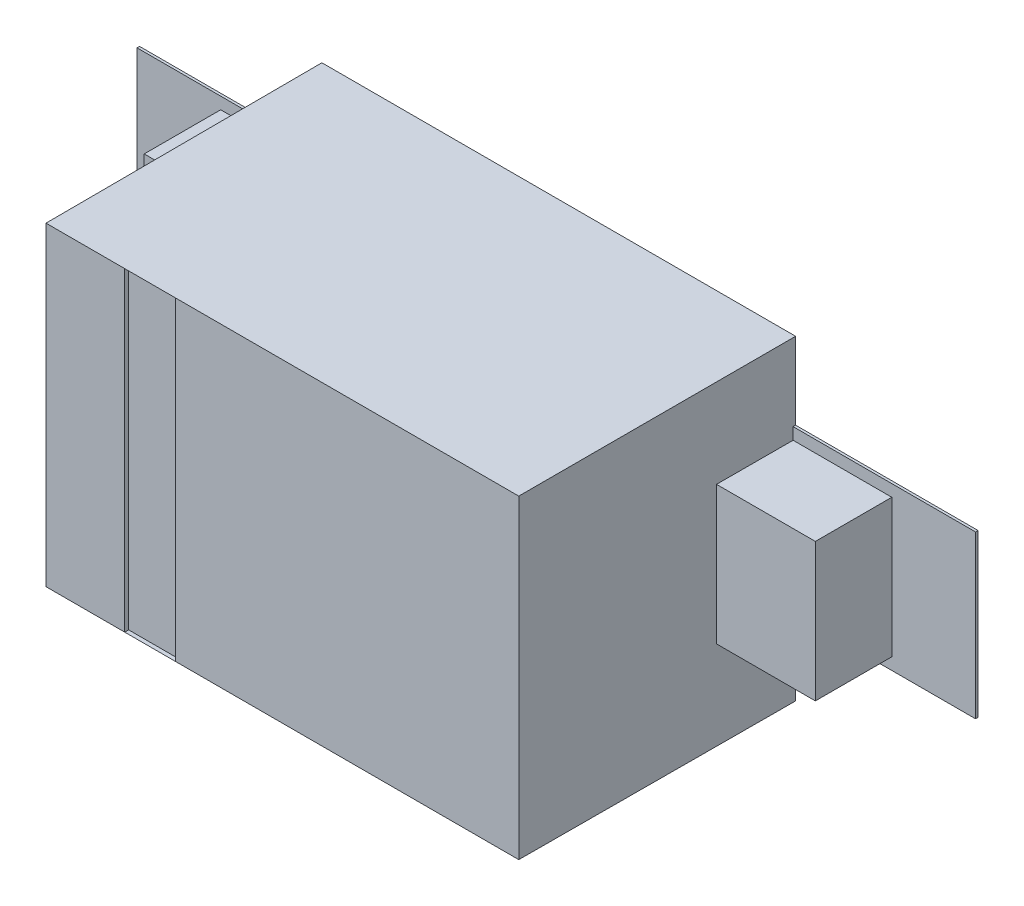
ISO-10303-21;
HEADER;
FILE_DESCRIPTION(('STEP AP214'),'2;1');
FILE_NAME('part.step','',(''),(''),'','','');
FILE_SCHEMA(('AUTOMOTIVE_DESIGN { 1 0 10303 214 1 1 1 1 }'));
ENDSEC;
DATA;
#1=APPLICATION_CONTEXT('core data for automotive mechanical design processes');
#2=APPLICATION_PROTOCOL_DEFINITION('international standard','automotive_design',2000,#1);
#3=PRODUCT_CONTEXT('',#1,'mechanical');
#4=PRODUCT('Part','Part','',(#3));
#5=PRODUCT_RELATED_PRODUCT_CATEGORY('part','',(#4));
#6=PRODUCT_DEFINITION_FORMATION('','',#4);
#7=PRODUCT_DEFINITION_CONTEXT('part definition',#1,'design');
#8=PRODUCT_DEFINITION('design','',#6,#7);
#9=PRODUCT_DEFINITION_SHAPE('','',#8);
#10=(LENGTH_UNIT() NAMED_UNIT(*) SI_UNIT(.MILLI.,.METRE.));
#11=(NAMED_UNIT(*) PLANE_ANGLE_UNIT() SI_UNIT($,.RADIAN.));
#12=(NAMED_UNIT(*) SI_UNIT($,.STERADIAN.) SOLID_ANGLE_UNIT());
#13=UNCERTAINTY_MEASURE_WITH_UNIT(LENGTH_MEASURE(1.E-05),#10,'distance_accuracy_value','');
#14=(GEOMETRIC_REPRESENTATION_CONTEXT(3) GLOBAL_UNCERTAINTY_ASSIGNED_CONTEXT((#13)) GLOBAL_UNIT_ASSIGNED_CONTEXT((#10,
#11,#12)) REPRESENTATION_CONTEXT('',''));
#15=CARTESIAN_POINT('',(0.,0.,0.));
#16=DIRECTION('',(0.,0.,1.));
#17=DIRECTION('',(1.,0.,0.));
#18=AXIS2_PLACEMENT_3D('',#15,#16,#17);
#19=CARTESIAN_POINT('',(0.849999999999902,0.175000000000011,0.0030000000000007));
#20=DIRECTION('',(1.,0.,0.));
#21=DIRECTION('',(0.,0.,-1.));
#22=AXIS2_PLACEMENT_3D('',#19,#20,#21);
#23=PLANE('',#22);
#24=DIRECTION('',(0.,0.,-1.));
#25=VECTOR('',#24,1.);
#26=CARTESIAN_POINT('',(0.849999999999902,-0.175000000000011,0.0030000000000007));
#27=LINE('',#26,#25);
#28=CARTESIAN_POINT('',(0.849999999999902,-0.175000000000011,0.0093500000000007));
#29=VERTEX_POINT('',#28);
#30=CARTESIAN_POINT('',(0.849999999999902,-0.175000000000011,0.203000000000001));
#31=VERTEX_POINT('',#30);
#32=EDGE_CURVE('E180',#29,#31,#27,.F.);
#33=ORIENTED_EDGE('',*,*,#32,.F.);
#34=DIRECTION('',(0.,1.,0.));
#35=VECTOR('',#34,1.);
#36=CARTESIAN_POINT('',(0.849999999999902,0.,0.0093500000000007));
#37=LINE('',#36,#35);
#38=CARTESIAN_POINT('',(0.849999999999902,0.175000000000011,0.0093500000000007));
#39=VERTEX_POINT('',#38);
#40=EDGE_CURVE('E260',#29,#39,#37,.T.);
#41=ORIENTED_EDGE('',*,*,#40,.T.);
#42=DIRECTION('',(0.,0.,1.));
#43=VECTOR('',#42,1.);
#44=CARTESIAN_POINT('',(0.849999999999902,0.175000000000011,0.0030000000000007));
#45=LINE('',#44,#43);
#46=CARTESIAN_POINT('',(0.849999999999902,0.175000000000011,0.203000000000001));
#47=VERTEX_POINT('',#46);
#48=EDGE_CURVE('E196',#47,#39,#45,.F.);
#49=ORIENTED_EDGE('',*,*,#48,.F.);
#50=DIRECTION('',(0.,1.,0.));
#51=VECTOR('',#50,1.);
#52=CARTESIAN_POINT('',(0.849999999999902,0.,0.203000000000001));
#53=LINE('',#52,#51);
#54=EDGE_CURVE('E174',#47,#31,#53,.F.);
#55=ORIENTED_EDGE('',*,*,#54,.T.);
#56=EDGE_LOOP('',(#33,#41,#49,#55));
#57=FACE_BOUND('',#56,.T.);
#58=ADVANCED_FACE('F16',(#57),#23,.T.);
#59=CARTESIAN_POINT('',(-0.849999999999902,-0.175000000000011,0.0030000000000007));
#60=DIRECTION('',(-1.,0.,0.));
#61=DIRECTION('',(0.,0.,1.));
#62=AXIS2_PLACEMENT_3D('',#59,#60,#61);
#63=PLANE('',#62);
#64=DIRECTION('',(0.,0.,1.));
#65=VECTOR('',#64,1.);
#66=CARTESIAN_POINT('',(-0.849999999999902,0.175000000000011,0.0030000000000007));
#67=LINE('',#66,#65);
#68=CARTESIAN_POINT('',(-0.849999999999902,0.175000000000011,0.0093500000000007));
#69=VERTEX_POINT('',#68);
#70=CARTESIAN_POINT('',(-0.849999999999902,0.175000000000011,0.203000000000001));
#71=VERTEX_POINT('',#70);
#72=EDGE_CURVE('E249',#69,#71,#67,.T.);
#73=ORIENTED_EDGE('',*,*,#72,.F.);
#74=DIRECTION('',(0.,1.,0.));
#75=VECTOR('',#74,1.);
#76=CARTESIAN_POINT('',(-0.849999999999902,0.,0.0093500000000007));
#77=LINE('',#76,#75);
#78=CARTESIAN_POINT('',(-0.849999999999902,-0.175000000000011,0.0093500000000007));
#79=VERTEX_POINT('',#78);
#80=EDGE_CURVE('E232',#69,#79,#77,.F.);
#81=ORIENTED_EDGE('',*,*,#80,.T.);
#82=DIRECTION('',(0.,0.,-1.));
#83=VECTOR('',#82,1.);
#84=CARTESIAN_POINT('',(-0.849999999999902,-0.175000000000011,0.0030000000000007));
#85=LINE('',#84,#83);
#86=CARTESIAN_POINT('',(-0.849999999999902,-0.175000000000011,0.203000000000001));
#87=VERTEX_POINT('',#86);
#88=EDGE_CURVE('E238',#87,#79,#85,.T.);
#89=ORIENTED_EDGE('',*,*,#88,.F.);
#90=DIRECTION('',(0.,1.,0.));
#91=VECTOR('',#90,1.);
#92=CARTESIAN_POINT('',(-0.849999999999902,0.,0.203000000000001));
#93=LINE('',#92,#91);
#94=EDGE_CURVE('E246',#87,#71,#93,.T.);
#95=ORIENTED_EDGE('',*,*,#94,.T.);
#96=EDGE_LOOP('',(#73,#81,#89,#95));
#97=FACE_BOUND('',#96,.T.);
#98=ADVANCED_FACE('F498',(#97),#63,.T.);
#99=CARTESIAN_POINT('',(-0.399389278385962,0.398778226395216,0.703023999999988));
#100=DIRECTION('',(-1.,0.,0.));
#101=DIRECTION('',(0.,0.,1.));
#102=AXIS2_PLACEMENT_3D('',#99,#100,#101);
#103=PLANE('',#102);
#104=DIRECTION('',(0.,1.,0.));
#105=VECTOR('',#104,1.);
#106=CARTESIAN_POINT('',(-0.399389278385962,0.,0.693024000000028));
#107=LINE('',#106,#105);
#108=CARTESIAN_POINT('',(-0.399389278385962,0.398778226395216,0.693024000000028));
#109=VERTEX_POINT('',#108);
#110=CARTESIAN_POINT('',(-0.399389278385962,-0.398778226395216,0.693024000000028));
#111=VERTEX_POINT('',#110);
#112=EDGE_CURVE('E19',#109,#111,#107,.F.);
#113=ORIENTED_EDGE('',*,*,#112,.F.);
#114=DIRECTION('',(0.,0.,1.));
#115=VECTOR('',#114,1.);
#116=CARTESIAN_POINT('',(-0.399389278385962,0.398778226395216,0.703023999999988));
#117=LINE('',#116,#115);
#118=CARTESIAN_POINT('',(-0.399389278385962,0.398778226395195,0.703023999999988));
#119=VERTEX_POINT('',#118);
#120=EDGE_CURVE('E251',#109,#119,#117,.T.);
#121=ORIENTED_EDGE('',*,*,#120,.T.);
#122=DIRECTION('',(0.,1.,0.));
#123=VECTOR('',#122,1.);
#124=CARTESIAN_POINT('',(-0.399389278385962,0.,0.703023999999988));
#125=LINE('',#124,#123);
#126=CARTESIAN_POINT('',(-0.399389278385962,-0.398778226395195,0.703023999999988));
#127=VERTEX_POINT('',#126);
#128=EDGE_CURVE('E221',#127,#119,#125,.T.);
#129=ORIENTED_EDGE('',*,*,#128,.F.);
#130=DIRECTION('',(0.,0.,-1.));
#131=VECTOR('',#130,1.);
#132=CARTESIAN_POINT('',(-0.399389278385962,-0.398778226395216,0.703023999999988));
#133=LINE('',#132,#131);
#134=EDGE_CURVE('E215',#127,#111,#133,.T.);
#135=ORIENTED_EDGE('',*,*,#134,.T.);
#136=EDGE_LOOP('',(#113,#121,#129,#135));
#137=FACE_BOUND('',#136,.T.);
#138=ADVANCED_FACE('F220',(#137),#103,.F.);
#139=CARTESIAN_POINT('',(0.,0.,0.693024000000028));
#140=DIRECTION('',(0.,0.,1.));
#141=DIRECTION('',(1.,0.,0.));
#142=AXIS2_PLACEMENT_3D('',#139,#140,#141);
#143=PLANE('',#142);
#144=DIRECTION('',(1.,0.,0.));
#145=VECTOR('',#144,1.);
#146=CARTESIAN_POINT('',(-0.270648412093,0.398778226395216,0.693024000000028));
#147=LINE('',#146,#145);
#148=CARTESIAN_POINT('',(-0.270648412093,0.398778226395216,0.693024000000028));
#149=VERTEX_POINT('',#148);
#150=EDGE_CURVE('E206',#149,#109,#147,.F.);
#151=ORIENTED_EDGE('',*,*,#150,.T.);
#152=ORIENTED_EDGE('',*,*,#112,.T.);
#153=DIRECTION('',(1.,0.,0.));
#154=VECTOR('',#153,1.);
#155=CARTESIAN_POINT('',(-0.399389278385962,-0.398778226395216,0.693024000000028));
#156=LINE('',#155,#154);
#157=CARTESIAN_POINT('',(-0.270648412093,-0.398778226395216,0.693024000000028));
#158=VERTEX_POINT('',#157);
#159=EDGE_CURVE('E205',#111,#158,#156,.T.);
#160=ORIENTED_EDGE('',*,*,#159,.T.);
#161=DIRECTION('',(0.,1.,0.));
#162=VECTOR('',#161,1.);
#163=CARTESIAN_POINT('',(-0.270648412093,-0.398778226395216,0.693024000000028));
#164=LINE('',#163,#162);
#165=EDGE_CURVE('E189',#158,#149,#164,.T.);
#166=ORIENTED_EDGE('',*,*,#165,.T.);
#167=EDGE_LOOP('',(#151,#152,#160,#166));
#168=FACE_BOUND('',#167,.T.);
#169=ADVANCED_FACE('F204',(#168),#143,.T.);
#170=CARTESIAN_POINT('',(-0.270648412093,-0.398778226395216,0.703023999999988));
#171=DIRECTION('',(1.,0.,0.));
#172=DIRECTION('',(0.,0.,-1.));
#173=AXIS2_PLACEMENT_3D('',#170,#171,#172);
#174=PLANE('',#173);
#175=ORIENTED_EDGE('',*,*,#165,.F.);
#176=DIRECTION('',(0.,0.,-1.));
#177=VECTOR('',#176,1.);
#178=CARTESIAN_POINT('',(-0.270648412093,-0.398778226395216,0.703023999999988));
#179=LINE('',#178,#177);
#180=CARTESIAN_POINT('',(-0.270648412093,-0.398778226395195,0.703023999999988));
#181=VERTEX_POINT('',#180);
#182=EDGE_CURVE('E218',#158,#181,#179,.F.);
#183=ORIENTED_EDGE('',*,*,#182,.T.);
#184=DIRECTION('',(0.,1.,0.));
#185=VECTOR('',#184,1.);
#186=CARTESIAN_POINT('',(-0.270648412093,0.,0.703023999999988));
#187=LINE('',#186,#185);
#188=CARTESIAN_POINT('',(-0.270648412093,0.398778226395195,0.703023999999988));
#189=VERTEX_POINT('',#188);
#190=EDGE_CURVE('E223',#189,#181,#187,.F.);
#191=ORIENTED_EDGE('',*,*,#190,.F.);
#192=DIRECTION('',(0.,0.,1.));
#193=VECTOR('',#192,1.);
#194=CARTESIAN_POINT('',(-0.270648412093,0.398778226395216,0.703023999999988));
#195=LINE('',#194,#193);
#196=EDGE_CURVE('E254',#189,#149,#195,.F.);
#197=ORIENTED_EDGE('',*,*,#196,.T.);
#198=EDGE_LOOP('',(#175,#183,#191,#197));
#199=FACE_BOUND('',#198,.T.);
#200=ADVANCED_FACE('F301',(#199),#174,.F.);
#201=CARTESIAN_POINT('',(0.849999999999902,-0.175000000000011,0.0030000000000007));
#202=DIRECTION('',(0.,-1.,0.));
#203=DIRECTION('',(0.,0.,-1.));
#204=AXIS2_PLACEMENT_3D('',#201,#202,#203);
#205=PLANE('',#204);
#206=DIRECTION('',(0.00174532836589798,0.,-0.999998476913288));
#207=VECTOR('',#206,1.);
#208=CARTESIAN_POINT('',(0.599999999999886,-0.175000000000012,0.0030000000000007));
#209=LINE('',#208,#207);
#210=CARTESIAN_POINT('',(0.599988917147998,-0.175000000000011,0.00935000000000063));
#211=VERTEX_POINT('',#210);
#212=CARTESIAN_POINT('',(0.599650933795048,-0.175000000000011,0.203000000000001));
#213=VERTEX_POINT('',#212);
#214=EDGE_CURVE('E275',#211,#213,#209,.F.);
#215=ORIENTED_EDGE('',*,*,#214,.F.);
#216=DIRECTION('',(-1.,0.,0.));
#217=VECTOR('',#216,1.);
#218=CARTESIAN_POINT('',(0.,-0.175000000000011,0.0093500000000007));
#219=LINE('',#218,#217);
#220=EDGE_CURVE('E185',#211,#29,#219,.F.);
#221=ORIENTED_EDGE('',*,*,#220,.T.);
#222=ORIENTED_EDGE('',*,*,#32,.T.);
#223=DIRECTION('',(-1.,0.,0.));
#224=VECTOR('',#223,1.);
#225=CARTESIAN_POINT('',(0.,-0.175000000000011,0.203000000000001));
#226=LINE('',#225,#224);
#227=EDGE_CURVE('E183',#31,#213,#226,.T.);
#228=ORIENTED_EDGE('',*,*,#227,.T.);
#229=EDGE_LOOP('',(#215,#221,#222,#228));
#230=FACE_BOUND('',#229,.T.);
#231=ADVANCED_FACE('F182',(#230),#205,.T.);
#232=CARTESIAN_POINT('',(0.,0.,0.203000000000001));
#233=DIRECTION('',(0.,0.,-1.));
#234=DIRECTION('',(-1.,0.,0.));
#235=AXIS2_PLACEMENT_3D('',#232,#233,#234);
#236=PLANE('',#235);
#237=ORIENTED_EDGE('',*,*,#54,.F.);
#238=DIRECTION('',(1.,0.,0.));
#239=VECTOR('',#238,1.);
#240=CARTESIAN_POINT('',(0.538999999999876,0.175000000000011,0.203000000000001));
#241=LINE('',#240,#239);
#242=CARTESIAN_POINT('',(0.599650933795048,0.175000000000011,0.203000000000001));
#243=VERTEX_POINT('',#242);
#244=EDGE_CURVE('E193',#243,#47,#241,.T.);
#245=ORIENTED_EDGE('',*,*,#244,.F.);
#246=DIRECTION('',(0.,1.,0.));
#247=VECTOR('',#246,1.);
#248=CARTESIAN_POINT('',(0.599650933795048,-25.831235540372,0.203000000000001));
#249=LINE('',#248,#247);
#250=EDGE_CURVE('E192',#213,#243,#249,.T.);
#251=ORIENTED_EDGE('',*,*,#250,.F.);
#252=ORIENTED_EDGE('',*,*,#227,.F.);
#253=EDGE_LOOP('',(#237,#245,#251,#252));
#254=FACE_BOUND('',#253,.T.);
#255=ADVANCED_FACE('F191',(#254),#236,.F.);
#256=CARTESIAN_POINT('',(0.538999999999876,0.175000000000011,0.0030000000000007));
#257=DIRECTION('',(0.,1.,0.));
#258=DIRECTION('',(0.,0.,1.));
#259=AXIS2_PLACEMENT_3D('',#256,#257,#258);
#260=PLANE('',#259);
#261=ORIENTED_EDGE('',*,*,#48,.T.);
#262=DIRECTION('',(-1.,0.,0.));
#263=VECTOR('',#262,1.);
#264=CARTESIAN_POINT('',(0.,0.175000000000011,0.0093500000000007));
#265=LINE('',#264,#263);
#266=CARTESIAN_POINT('',(0.599988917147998,0.175000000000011,0.00935000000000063));
#267=VERTEX_POINT('',#266);
#268=EDGE_CURVE('E257',#39,#267,#265,.T.);
#269=ORIENTED_EDGE('',*,*,#268,.T.);
#270=DIRECTION('',(0.00174532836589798,0.,-0.999998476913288));
#271=VECTOR('',#270,1.);
#272=CARTESIAN_POINT('',(0.599999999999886,0.175000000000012,0.0030000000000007));
#273=LINE('',#272,#271);
#274=EDGE_CURVE('E267',#243,#267,#273,.T.);
#275=ORIENTED_EDGE('',*,*,#274,.F.);
#276=ORIENTED_EDGE('',*,*,#244,.T.);
#277=EDGE_LOOP('',(#261,#269,#275,#276));
#278=FACE_BOUND('',#277,.T.);
#279=ADVANCED_FACE('F265',(#278),#260,.T.);
#280=CARTESIAN_POINT('',(0.,0.,0.0093500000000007));
#281=DIRECTION('',(0.,0.,-1.));
#282=DIRECTION('',(-1.,0.,0.));
#283=AXIS2_PLACEMENT_3D('',#280,#281,#282);
#284=PLANE('',#283);
#285=ORIENTED_EDGE('',*,*,#40,.F.);
#286=ORIENTED_EDGE('',*,*,#220,.F.);
#287=DIRECTION('',(0.,1.,0.));
#288=VECTOR('',#287,1.);
#289=CARTESIAN_POINT('',(0.599988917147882,-25.831235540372,0.00935000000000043));
#290=LINE('',#289,#288);
#291=CARTESIAN_POINT('',(0.599988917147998,-0.204999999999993,0.00935000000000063));
#292=VERTEX_POINT('',#291);
#293=EDGE_CURVE('E280',#292,#211,#290,.T.);
#294=ORIENTED_EDGE('',*,*,#293,.F.);
#295=DIRECTION('',(1.,0.,0.));
#296=VECTOR('',#295,1.);
#297=CARTESIAN_POINT('',(1.06200000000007,-0.204999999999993,0.0093500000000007));
#298=LINE('',#297,#296);
#299=CARTESIAN_POINT('',(1.06200000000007,-0.204999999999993,0.0093500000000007));
#300=VERTEX_POINT('',#299);
#301=EDGE_CURVE('E298',#300,#292,#298,.F.);
#302=ORIENTED_EDGE('',*,*,#301,.F.);
#303=DIRECTION('',(0.,1.,0.));
#304=VECTOR('',#303,1.);
#305=CARTESIAN_POINT('',(1.06200000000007,0.204999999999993,0.0093500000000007));
#306=LINE('',#305,#304);
#307=CARTESIAN_POINT('',(1.06200000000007,0.204999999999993,0.0093500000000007));
#308=VERTEX_POINT('',#307);
#309=EDGE_CURVE('E296',#308,#300,#306,.F.);
#310=ORIENTED_EDGE('',*,*,#309,.F.);
#311=DIRECTION('',(1.,0.,0.));
#312=VECTOR('',#311,1.);
#313=CARTESIAN_POINT('',(0.372000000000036,0.204999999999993,0.0093500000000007));
#314=LINE('',#313,#312);
#315=CARTESIAN_POINT('',(0.599988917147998,0.204999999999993,0.00935000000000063));
#316=VERTEX_POINT('',#315);
#317=EDGE_CURVE('E292',#316,#308,#314,.T.);
#318=ORIENTED_EDGE('',*,*,#317,.F.);
#319=DIRECTION('',(0.,1.,0.));
#320=VECTOR('',#319,1.);
#321=CARTESIAN_POINT('',(0.599988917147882,-25.831235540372,0.00935000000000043));
#322=LINE('',#321,#320);
#323=EDGE_CURVE('E271',#267,#316,#322,.T.);
#324=ORIENTED_EDGE('',*,*,#323,.F.);
#325=ORIENTED_EDGE('',*,*,#268,.F.);
#326=EDGE_LOOP('',(#285,#286,#294,#302,#310,#318,#324,#325));
#327=FACE_BOUND('',#326,.T.);
#328=ADVANCED_FACE('F425',(#327),#284,.F.);
#329=CARTESIAN_POINT('',(-0.270648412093,0.398778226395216,0.703023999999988));
#330=DIRECTION('',(0.,1.,0.));
#331=DIRECTION('',(0.,0.,1.));
#332=AXIS2_PLACEMENT_3D('',#329,#330,#331);
#333=PLANE('',#332);
#334=ORIENTED_EDGE('',*,*,#150,.F.);
#335=ORIENTED_EDGE('',*,*,#196,.F.);
#336=DIRECTION('',(1.,0.,0.));
#337=VECTOR('',#336,1.);
#338=CARTESIAN_POINT('',(26.0312355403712,0.398778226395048,0.703023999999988));
#339=LINE('',#338,#337);
#340=EDGE_CURVE('E351',#119,#189,#339,.T.);
#341=ORIENTED_EDGE('',*,*,#340,.F.);
#342=ORIENTED_EDGE('',*,*,#120,.F.);
#343=EDGE_LOOP('',(#334,#335,#341,#342));
#344=FACE_BOUND('',#343,.T.);
#345=ADVANCED_FACE('F422',(#344),#333,.F.);
#346=CARTESIAN_POINT('',(-0.849999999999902,0.175000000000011,0.0030000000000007));
#347=DIRECTION('',(0.,1.,0.));
#348=DIRECTION('',(0.,0.,1.));
#349=AXIS2_PLACEMENT_3D('',#346,#347,#348);
#350=PLANE('',#349);
#351=DIRECTION('',(-1.,0.,0.));
#352=VECTOR('',#351,1.);
#353=CARTESIAN_POINT('',(0.,0.175000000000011,0.203000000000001));
#354=LINE('',#353,#352);
#355=CARTESIAN_POINT('',(-0.599650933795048,0.175000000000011,0.203000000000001));
#356=VERTEX_POINT('',#355);
#357=EDGE_CURVE('E243',#71,#356,#354,.F.);
#358=ORIENTED_EDGE('',*,*,#357,.T.);
#359=DIRECTION('',(0.00174532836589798,0.,0.999998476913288));
#360=VECTOR('',#359,1.);
#361=CARTESIAN_POINT('',(-0.599999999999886,0.175000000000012,0.0030000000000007));
#362=LINE('',#361,#360);
#363=CARTESIAN_POINT('',(-0.599988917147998,0.175000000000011,0.00935000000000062));
#364=VERTEX_POINT('',#363);
#365=EDGE_CURVE('E339',#364,#356,#362,.T.);
#366=ORIENTED_EDGE('',*,*,#365,.F.);
#367=DIRECTION('',(-1.,0.,0.));
#368=VECTOR('',#367,1.);
#369=CARTESIAN_POINT('',(0.,0.175000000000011,0.0093500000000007));
#370=LINE('',#369,#368);
#371=EDGE_CURVE('E235',#364,#69,#370,.T.);
#372=ORIENTED_EDGE('',*,*,#371,.T.);
#373=ORIENTED_EDGE('',*,*,#72,.T.);
#374=EDGE_LOOP('',(#358,#366,#372,#373));
#375=FACE_BOUND('',#374,.T.);
#376=ADVANCED_FACE('F424',(#375),#350,.T.);
#377=CARTESIAN_POINT('',(0.,0.,0.203000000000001));
#378=DIRECTION('',(0.,0.,-1.));
#379=DIRECTION('',(-1.,0.,0.));
#380=AXIS2_PLACEMENT_3D('',#377,#378,#379);
#381=PLANE('',#380);
#382=ORIENTED_EDGE('',*,*,#94,.F.);
#383=DIRECTION('',(1.,0.,0.));
#384=VECTOR('',#383,1.);
#385=CARTESIAN_POINT('',(-0.538999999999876,-0.175000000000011,0.203000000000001));
#386=LINE('',#385,#384);
#387=CARTESIAN_POINT('',(-0.599650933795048,-0.175000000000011,0.203000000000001));
#388=VERTEX_POINT('',#387);
#389=EDGE_CURVE('E240',#388,#87,#386,.F.);
#390=ORIENTED_EDGE('',*,*,#389,.F.);
#391=DIRECTION('',(0.,1.,0.));
#392=VECTOR('',#391,1.);
#393=CARTESIAN_POINT('',(-0.599650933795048,25.831235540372,0.203000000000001));
#394=LINE('',#393,#392);
#395=EDGE_CURVE('E337',#356,#388,#394,.F.);
#396=ORIENTED_EDGE('',*,*,#395,.F.);
#397=ORIENTED_EDGE('',*,*,#357,.F.);
#398=EDGE_LOOP('',(#382,#390,#396,#397));
#399=FACE_BOUND('',#398,.T.);
#400=ADVANCED_FACE('F432',(#399),#381,.F.);
#401=CARTESIAN_POINT('',(-0.538999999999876,-0.175000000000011,0.0030000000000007));
#402=DIRECTION('',(0.,-1.,0.));
#403=DIRECTION('',(0.,0.,-1.));
#404=AXIS2_PLACEMENT_3D('',#401,#402,#403);
#405=PLANE('',#404);
#406=DIRECTION('',(-1.,0.,0.));
#407=VECTOR('',#406,1.);
#408=CARTESIAN_POINT('',(0.,-0.175000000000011,0.0093500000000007));
#409=LINE('',#408,#407);
#410=CARTESIAN_POINT('',(-0.599988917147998,-0.175000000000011,0.00935000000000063));
#411=VERTEX_POINT('',#410);
#412=EDGE_CURVE('E229',#79,#411,#409,.F.);
#413=ORIENTED_EDGE('',*,*,#412,.T.);
#414=DIRECTION('',(0.00174532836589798,0.,0.999998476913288));
#415=VECTOR('',#414,1.);
#416=CARTESIAN_POINT('',(-0.599999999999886,-0.175000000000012,0.0030000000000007));
#417=LINE('',#416,#415);
#418=EDGE_CURVE('E335',#388,#411,#417,.F.);
#419=ORIENTED_EDGE('',*,*,#418,.F.);
#420=ORIENTED_EDGE('',*,*,#389,.T.);
#421=ORIENTED_EDGE('',*,*,#88,.T.);
#422=EDGE_LOOP('',(#413,#419,#420,#421));
#423=FACE_BOUND('',#422,.T.);
#424=ADVANCED_FACE('F482',(#423),#405,.T.);
#425=CARTESIAN_POINT('',(0.,0.,0.0093500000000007));
#426=DIRECTION('',(0.,0.,-1.));
#427=DIRECTION('',(-1.,0.,0.));
#428=AXIS2_PLACEMENT_3D('',#425,#426,#427);
#429=PLANE('',#428);
#430=DIRECTION('',(0.,1.,0.));
#431=VECTOR('',#430,1.);
#432=CARTESIAN_POINT('',(-1.06200000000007,-0.204999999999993,0.0093500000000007));
#433=LINE('',#432,#431);
#434=CARTESIAN_POINT('',(-1.06200000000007,-0.204999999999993,0.0093500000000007));
#435=VERTEX_POINT('',#434);
#436=CARTESIAN_POINT('',(-1.06200000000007,0.204999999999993,0.0093500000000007));
#437=VERTEX_POINT('',#436);
#438=EDGE_CURVE('E347',#435,#437,#433,.T.);
#439=ORIENTED_EDGE('',*,*,#438,.F.);
#440=DIRECTION('',(1.,0.,0.));
#441=VECTOR('',#440,1.);
#442=CARTESIAN_POINT('',(-0.372000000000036,-0.204999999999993,0.0093500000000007));
#443=LINE('',#442,#441);
#444=CARTESIAN_POINT('',(-0.599988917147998,-0.204999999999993,0.00935000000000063));
#445=VERTEX_POINT('',#444);
#446=EDGE_CURVE('E343',#445,#435,#443,.F.);
#447=ORIENTED_EDGE('',*,*,#446,.F.);
#448=DIRECTION('',(0.,1.,0.));
#449=VECTOR('',#448,1.);
#450=CARTESIAN_POINT('',(-0.599988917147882,25.831235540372,0.00935000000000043));
#451=LINE('',#450,#449);
#452=EDGE_CURVE('E333',#411,#445,#451,.F.);
#453=ORIENTED_EDGE('',*,*,#452,.F.);
#454=ORIENTED_EDGE('',*,*,#412,.F.);
#455=ORIENTED_EDGE('',*,*,#80,.F.);
#456=ORIENTED_EDGE('',*,*,#371,.F.);
#457=DIRECTION('',(0.,1.,0.));
#458=VECTOR('',#457,1.);
#459=CARTESIAN_POINT('',(-0.599988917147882,25.831235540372,0.00935000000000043));
#460=LINE('',#459,#458);
#461=CARTESIAN_POINT('',(-0.599988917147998,0.204999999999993,0.00935000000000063));
#462=VERTEX_POINT('',#461);
#463=EDGE_CURVE('E321',#462,#364,#460,.F.);
#464=ORIENTED_EDGE('',*,*,#463,.F.);
#465=DIRECTION('',(1.,0.,0.));
#466=VECTOR('',#465,1.);
#467=CARTESIAN_POINT('',(-1.06200000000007,0.204999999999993,0.0093500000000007));
#468=LINE('',#467,#466);
#469=EDGE_CURVE('E349',#437,#462,#468,.T.);
#470=ORIENTED_EDGE('',*,*,#469,.F.);
#471=EDGE_LOOP('',(#439,#447,#453,#454,#455,#456,#464,#470));
#472=FACE_BOUND('',#471,.T.);
#473=ADVANCED_FACE('F479',(#472),#429,.F.);
#474=CARTESIAN_POINT('',(0.,0.,0.703023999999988));
#475=DIRECTION('',(0.,0.,1.));
#476=DIRECTION('',(1.,0.,0.));
#477=AXIS2_PLACEMENT_3D('',#474,#475,#476);
#478=PLANE('',#477);
#479=DIRECTION('',(1.,0.,0.));
#480=VECTOR('',#479,1.);
#481=CARTESIAN_POINT('',(-26.0312355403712,-0.398778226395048,0.703023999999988));
#482=LINE('',#481,#480);
#483=CARTESIAN_POINT('',(-0.598778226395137,-0.398778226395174,0.703023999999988));
#484=VERTEX_POINT('',#483);
#485=EDGE_CURVE('E319',#127,#484,#482,.F.);
#486=ORIENTED_EDGE('',*,*,#485,.F.);
#487=ORIENTED_EDGE('',*,*,#128,.T.);
#488=DIRECTION('',(1.,0.,0.));
#489=VECTOR('',#488,1.);
#490=CARTESIAN_POINT('',(26.0312355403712,0.398778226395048,0.703023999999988));
#491=LINE('',#490,#489);
#492=CARTESIAN_POINT('',(-0.598778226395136,0.398778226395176,0.703023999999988));
#493=VERTEX_POINT('',#492);
#494=EDGE_CURVE('E353',#493,#119,#491,.T.);
#495=ORIENTED_EDGE('',*,*,#494,.F.);
#496=DIRECTION('',(0.,1.,0.));
#497=VECTOR('',#496,1.);
#498=CARTESIAN_POINT('',(-0.598778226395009,25.831235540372,0.703023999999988));
#499=LINE('',#498,#497);
#500=EDGE_CURVE('E329',#484,#493,#499,.T.);
#501=ORIENTED_EDGE('',*,*,#500,.F.);
#502=EDGE_LOOP('',(#486,#487,#495,#501));
#503=FACE_BOUND('',#502,.T.);
#504=ADVANCED_FACE('F476',(#503),#478,.T.);
#505=CARTESIAN_POINT('',(0.,0.,0.703023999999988));
#506=DIRECTION('',(0.,0.,1.));
#507=DIRECTION('',(1.,0.,0.));
#508=AXIS2_PLACEMENT_3D('',#505,#506,#507);
#509=PLANE('',#508);
#510=DIRECTION('',(1.,0.,0.));
#511=VECTOR('',#510,1.);
#512=CARTESIAN_POINT('',(26.0312355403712,0.398778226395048,0.703023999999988));
#513=LINE('',#512,#511);
#514=CARTESIAN_POINT('',(0.598778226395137,0.398778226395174,0.703023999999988));
#515=VERTEX_POINT('',#514);
#516=EDGE_CURVE('E273',#189,#515,#513,.T.);
#517=ORIENTED_EDGE('',*,*,#516,.F.);
#518=ORIENTED_EDGE('',*,*,#190,.T.);
#519=DIRECTION('',(1.,0.,0.));
#520=VECTOR('',#519,1.);
#521=CARTESIAN_POINT('',(-26.0312355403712,-0.398778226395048,0.703023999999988));
#522=LINE('',#521,#520);
#523=CARTESIAN_POINT('',(0.598778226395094,-0.398778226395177,0.703023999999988));
#524=VERTEX_POINT('',#523);
#525=EDGE_CURVE('E307',#524,#181,#522,.F.);
#526=ORIENTED_EDGE('',*,*,#525,.F.);
#527=DIRECTION('',(0.,1.,0.));
#528=VECTOR('',#527,1.);
#529=CARTESIAN_POINT('',(0.598778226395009,-25.831235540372,0.703023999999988));
#530=LINE('',#529,#528);
#531=EDGE_CURVE('E286',#515,#524,#530,.F.);
#532=ORIENTED_EDGE('',*,*,#531,.F.);
#533=EDGE_LOOP('',(#517,#518,#526,#532));
#534=FACE_BOUND('',#533,.T.);
#535=ADVANCED_FACE('F367',(#534),#509,.T.);
#536=CARTESIAN_POINT('',(-0.399389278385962,-0.398778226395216,0.703023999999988));
#537=DIRECTION('',(0.,-1.,0.));
#538=DIRECTION('',(0.,0.,-1.));
#539=AXIS2_PLACEMENT_3D('',#536,#537,#538);
#540=PLANE('',#539);
#541=ORIENTED_EDGE('',*,*,#159,.F.);
#542=ORIENTED_EDGE('',*,*,#134,.F.);
#543=DIRECTION('',(1.,0.,0.));
#544=VECTOR('',#543,1.);
#545=CARTESIAN_POINT('',(-26.0312355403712,-0.398778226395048,0.703023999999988));
#546=LINE('',#545,#544);
#547=EDGE_CURVE('E303',#181,#127,#546,.F.);
#548=ORIENTED_EDGE('',*,*,#547,.F.);
#549=ORIENTED_EDGE('',*,*,#182,.F.);
#550=EDGE_LOOP('',(#541,#542,#548,#549));
#551=FACE_BOUND('',#550,.T.);
#552=ADVANCED_FACE('F213',(#551),#540,.F.);
#553=CARTESIAN_POINT('',(1.06200000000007,-0.204999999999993,0.0030000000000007));
#554=DIRECTION('',(0.,-1.,0.));
#555=DIRECTION('',(0.,0.,-1.));
#556=AXIS2_PLACEMENT_3D('',#553,#554,#555);
#557=PLANE('',#556);
#558=ORIENTED_EDGE('',*,*,#301,.T.);
#559=DIRECTION('',(0.00174532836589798,0.,-0.999998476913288));
#560=VECTOR('',#559,1.);
#561=CARTESIAN_POINT('',(0.599999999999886,-0.204999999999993,0.0030000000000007));
#562=LINE('',#561,#560);
#563=CARTESIAN_POINT('',(0.599999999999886,-0.204999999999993,0.0030000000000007));
#564=VERTEX_POINT('',#563);
#565=EDGE_CURVE('E283',#564,#292,#562,.F.);
#566=ORIENTED_EDGE('',*,*,#565,.F.);
#567=DIRECTION('',(1.,0.,0.));
#568=VECTOR('',#567,1.);
#569=CARTESIAN_POINT('',(0.,-0.204999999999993,0.0030000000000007));
#570=LINE('',#569,#568);
#571=CARTESIAN_POINT('',(1.06200000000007,-0.204999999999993,0.0030000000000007));
#572=VERTEX_POINT('',#571);
#573=EDGE_CURVE('E310',#564,#572,#570,.T.);
#574=ORIENTED_EDGE('',*,*,#573,.T.);
#575=DIRECTION('',(0.,0.,-1.));
#576=VECTOR('',#575,1.);
#577=CARTESIAN_POINT('',(1.06200000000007,-0.204999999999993,0.0030000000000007));
#578=LINE('',#577,#576);
#579=EDGE_CURVE('E294',#300,#572,#578,.T.);
#580=ORIENTED_EDGE('',*,*,#579,.F.);
#581=EDGE_LOOP('',(#558,#566,#574,#580));
#582=FACE_BOUND('',#581,.T.);
#583=ADVANCED_FACE('F391',(#582),#557,.T.);
#584=CARTESIAN_POINT('',(1.06200000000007,0.204999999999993,0.0030000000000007));
#585=DIRECTION('',(1.,0.,0.));
#586=DIRECTION('',(0.,0.,-1.));
#587=AXIS2_PLACEMENT_3D('',#584,#585,#586);
#588=PLANE('',#587);
#589=ORIENTED_EDGE('',*,*,#579,.T.);
#590=DIRECTION('',(0.,1.,0.));
#591=VECTOR('',#590,1.);
#592=CARTESIAN_POINT('',(1.06200000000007,0.,0.0030000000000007));
#593=LINE('',#592,#591);
#594=CARTESIAN_POINT('',(1.06200000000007,0.204999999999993,0.0030000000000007));
#595=VERTEX_POINT('',#594);
#596=EDGE_CURVE('E382',#572,#595,#593,.T.);
#597=ORIENTED_EDGE('',*,*,#596,.T.);
#598=DIRECTION('',(0.,0.,1.));
#599=VECTOR('',#598,1.);
#600=CARTESIAN_POINT('',(1.06200000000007,0.204999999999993,0.0030000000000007));
#601=LINE('',#600,#599);
#602=EDGE_CURVE('E290',#308,#595,#601,.F.);
#603=ORIENTED_EDGE('',*,*,#602,.F.);
#604=ORIENTED_EDGE('',*,*,#309,.T.);
#605=EDGE_LOOP('',(#589,#597,#603,#604));
#606=FACE_BOUND('',#605,.T.);
#607=ADVANCED_FACE('F465',(#606),#588,.T.);
#608=CARTESIAN_POINT('',(0.372000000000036,0.204999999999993,0.0030000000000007));
#609=DIRECTION('',(0.,1.,0.));
#610=DIRECTION('',(0.,0.,1.));
#611=AXIS2_PLACEMENT_3D('',#608,#609,#610);
#612=PLANE('',#611);
#613=DIRECTION('',(1.,0.,0.));
#614=VECTOR('',#613,1.);
#615=CARTESIAN_POINT('',(0.,0.204999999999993,0.0030000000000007));
#616=LINE('',#615,#614);
#617=CARTESIAN_POINT('',(0.599999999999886,0.204999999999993,0.0030000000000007));
#618=VERTEX_POINT('',#617);
#619=EDGE_CURVE('E378',#595,#618,#616,.F.);
#620=ORIENTED_EDGE('',*,*,#619,.T.);
#621=DIRECTION('',(0.00174532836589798,0.,-0.999998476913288));
#622=VECTOR('',#621,1.);
#623=CARTESIAN_POINT('',(0.599999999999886,0.204999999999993,0.0030000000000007));
#624=LINE('',#623,#622);
#625=EDGE_CURVE('E288',#316,#618,#624,.T.);
#626=ORIENTED_EDGE('',*,*,#625,.F.);
#627=ORIENTED_EDGE('',*,*,#317,.T.);
#628=ORIENTED_EDGE('',*,*,#602,.T.);
#629=EDGE_LOOP('',(#620,#626,#627,#628));
#630=FACE_BOUND('',#629,.T.);
#631=ADVANCED_FACE('F462',(#630),#612,.T.);
#632=CARTESIAN_POINT('',(0.599999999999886,-25.831235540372,0.0030000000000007));
#633=DIRECTION('',(0.999998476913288,0.,0.00174532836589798));
#634=DIRECTION('',(0.00174532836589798,0.,-0.999998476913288));
#635=AXIS2_PLACEMENT_3D('',#632,#633,#634);
#636=PLANE('',#635);
#637=ORIENTED_EDGE('',*,*,#274,.T.);
#638=ORIENTED_EDGE('',*,*,#323,.T.);
#639=ORIENTED_EDGE('',*,*,#625,.T.);
#640=DIRECTION('',(0.,1.,0.));
#641=VECTOR('',#640,1.);
#642=CARTESIAN_POINT('',(0.599999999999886,0.,0.0030000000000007));
#643=LINE('',#642,#641);
#644=CARTESIAN_POINT('',(0.599999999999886,0.399999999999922,0.00300000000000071));
#645=VERTEX_POINT('',#644);
#646=EDGE_CURVE('E372',#618,#645,#643,.T.);
#647=ORIENTED_EDGE('',*,*,#646,.T.);
#648=DIRECTION('',(0.00174532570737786,0.00174532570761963,-0.999996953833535));
#649=VECTOR('',#648,1.);
#650=CARTESIAN_POINT('',(0.598778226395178,0.398778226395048,0.703023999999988));
#651=LINE('',#650,#649);
#652=EDGE_CURVE('E356',#515,#645,#651,.T.);
#653=ORIENTED_EDGE('',*,*,#652,.F.);
#654=ORIENTED_EDGE('',*,*,#531,.T.);
#655=DIRECTION('',(-0.00174532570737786,0.00174532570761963,0.999996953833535));
#656=VECTOR('',#655,1.);
#657=CARTESIAN_POINT('',(0.599999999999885,-0.399999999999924,0.0030000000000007));
#658=LINE('',#657,#656);
#659=CARTESIAN_POINT('',(0.599999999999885,-0.399999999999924,0.00300000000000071));
#660=VERTEX_POINT('',#659);
#661=EDGE_CURVE('E312',#660,#524,#658,.T.);
#662=ORIENTED_EDGE('',*,*,#661,.F.);
#663=DIRECTION('',(0.,1.,0.));
#664=VECTOR('',#663,1.);
#665=CARTESIAN_POINT('',(0.599999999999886,0.,0.0030000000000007));
#666=LINE('',#665,#664);
#667=EDGE_CURVE('E306',#660,#564,#666,.T.);
#668=ORIENTED_EDGE('',*,*,#667,.T.);
#669=ORIENTED_EDGE('',*,*,#565,.T.);
#670=ORIENTED_EDGE('',*,*,#293,.T.);
#671=ORIENTED_EDGE('',*,*,#214,.T.);
#672=ORIENTED_EDGE('',*,*,#250,.T.);
#673=EDGE_LOOP('',(#637,#638,#639,#647,#653,#654,#662,#668,#669,#670,#671,#672));
#674=FACE_BOUND('',#673,.T.);
#675=ADVANCED_FACE('F370',(#674),#636,.T.);
#676=CARTESIAN_POINT('',(26.0312355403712,0.399999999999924,0.0030000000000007));
#677=DIRECTION('',(0.,0.999998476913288,0.00174532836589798));
#678=DIRECTION('',(0.,-0.00174532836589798,0.999998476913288));
#679=AXIS2_PLACEMENT_3D('',#676,#677,#678);
#680=PLANE('',#679);
#681=ORIENTED_EDGE('',*,*,#494,.T.);
#682=ORIENTED_EDGE('',*,*,#340,.T.);
#683=ORIENTED_EDGE('',*,*,#516,.T.);
#684=ORIENTED_EDGE('',*,*,#652,.T.);
#685=DIRECTION('',(1.,0.,0.));
#686=VECTOR('',#685,1.);
#687=CARTESIAN_POINT('',(0.,0.399999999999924,0.0030000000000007));
#688=LINE('',#687,#686);
#689=CARTESIAN_POINT('',(-0.599999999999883,0.399999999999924,0.00300000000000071));
#690=VERTEX_POINT('',#689);
#691=EDGE_CURVE('E377',#645,#690,#688,.F.);
#692=ORIENTED_EDGE('',*,*,#691,.T.);
#693=DIRECTION('',(-0.00174532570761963,0.00174532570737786,-0.999996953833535));
#694=VECTOR('',#693,1.);
#695=CARTESIAN_POINT('',(-0.598778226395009,0.398778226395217,0.703023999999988));
#696=LINE('',#695,#694);
#697=EDGE_CURVE('E327',#493,#690,#696,.T.);
#698=ORIENTED_EDGE('',*,*,#697,.F.);
#699=EDGE_LOOP('',(#681,#682,#683,#684,#692,#698));
#700=FACE_BOUND('',#699,.T.);
#701=ADVANCED_FACE('F360',(#700),#680,.T.);
#702=CARTESIAN_POINT('',(-1.06200000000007,0.204999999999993,0.0030000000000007));
#703=DIRECTION('',(0.,1.,0.));
#704=DIRECTION('',(0.,0.,1.));
#705=AXIS2_PLACEMENT_3D('',#702,#703,#704);
#706=PLANE('',#705);
#707=ORIENTED_EDGE('',*,*,#469,.T.);
#708=DIRECTION('',(0.00174532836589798,0.,0.999998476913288));
#709=VECTOR('',#708,1.);
#710=CARTESIAN_POINT('',(-0.599999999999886,0.204999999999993,0.0030000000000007));
#711=LINE('',#710,#709);
#712=CARTESIAN_POINT('',(-0.599999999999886,0.204999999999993,0.0030000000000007));
#713=VERTEX_POINT('',#712);
#714=EDGE_CURVE('E324',#713,#462,#711,.T.);
#715=ORIENTED_EDGE('',*,*,#714,.F.);
#716=DIRECTION('',(1.,0.,0.));
#717=VECTOR('',#716,1.);
#718=CARTESIAN_POINT('',(0.,0.204999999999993,0.0030000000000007));
#719=LINE('',#718,#717);
#720=CARTESIAN_POINT('',(-1.06200000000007,0.204999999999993,0.0030000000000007));
#721=VERTEX_POINT('',#720);
#722=EDGE_CURVE('E410',#713,#721,#719,.F.);
#723=ORIENTED_EDGE('',*,*,#722,.T.);
#724=DIRECTION('',(0.,0.,1.));
#725=VECTOR('',#724,1.);
#726=CARTESIAN_POINT('',(-1.06200000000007,0.204999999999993,0.0030000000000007));
#727=LINE('',#726,#725);
#728=EDGE_CURVE('E345',#437,#721,#727,.F.);
#729=ORIENTED_EDGE('',*,*,#728,.F.);
#730=EDGE_LOOP('',(#707,#715,#723,#729));
#731=FACE_BOUND('',#730,.T.);
#732=ADVANCED_FACE('F453',(#731),#706,.T.);
#733=CARTESIAN_POINT('',(-1.06200000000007,-0.204999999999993,0.0030000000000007));
#734=DIRECTION('',(-1.,0.,0.));
#735=DIRECTION('',(0.,0.,1.));
#736=AXIS2_PLACEMENT_3D('',#733,#734,#735);
#737=PLANE('',#736);
#738=ORIENTED_EDGE('',*,*,#728,.T.);
#739=DIRECTION('',(0.,1.,0.));
#740=VECTOR('',#739,1.);
#741=CARTESIAN_POINT('',(-1.06200000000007,0.,0.0030000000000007));
#742=LINE('',#741,#740);
#743=CARTESIAN_POINT('',(-1.06200000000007,-0.204999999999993,0.0030000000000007));
#744=VERTEX_POINT('',#743);
#745=EDGE_CURVE('E405',#721,#744,#742,.F.);
#746=ORIENTED_EDGE('',*,*,#745,.T.);
#747=DIRECTION('',(0.,0.,-1.));
#748=VECTOR('',#747,1.);
#749=CARTESIAN_POINT('',(-1.06200000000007,-0.204999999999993,0.0030000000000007));
#750=LINE('',#749,#748);
#751=EDGE_CURVE('E341',#435,#744,#750,.T.);
#752=ORIENTED_EDGE('',*,*,#751,.F.);
#753=ORIENTED_EDGE('',*,*,#438,.T.);
#754=EDGE_LOOP('',(#738,#746,#752,#753));
#755=FACE_BOUND('',#754,.T.);
#756=ADVANCED_FACE('F449',(#755),#737,.T.);
#757=CARTESIAN_POINT('',(-0.372000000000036,-0.204999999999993,0.0030000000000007));
#758=DIRECTION('',(0.,-1.,0.));
#759=DIRECTION('',(0.,0.,-1.));
#760=AXIS2_PLACEMENT_3D('',#757,#758,#759);
#761=PLANE('',#760);
#762=DIRECTION('',(1.,0.,0.));
#763=VECTOR('',#762,1.);
#764=CARTESIAN_POINT('',(0.,-0.204999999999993,0.0030000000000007));
#765=LINE('',#764,#763);
#766=CARTESIAN_POINT('',(-0.599999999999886,-0.204999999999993,0.0030000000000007));
#767=VERTEX_POINT('',#766);
#768=EDGE_CURVE('E403',#744,#767,#765,.T.);
#769=ORIENTED_EDGE('',*,*,#768,.T.);
#770=DIRECTION('',(0.00174532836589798,0.,0.999998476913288));
#771=VECTOR('',#770,1.);
#772=CARTESIAN_POINT('',(-0.599999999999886,-0.204999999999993,0.0030000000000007));
#773=LINE('',#772,#771);
#774=EDGE_CURVE('E331',#445,#767,#773,.F.);
#775=ORIENTED_EDGE('',*,*,#774,.F.);
#776=ORIENTED_EDGE('',*,*,#446,.T.);
#777=ORIENTED_EDGE('',*,*,#751,.T.);
#778=EDGE_LOOP('',(#769,#775,#776,#777));
#779=FACE_BOUND('',#778,.T.);
#780=ADVANCED_FACE('F446',(#779),#761,.T.);
#781=CARTESIAN_POINT('',(-0.599999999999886,25.831235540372,0.0030000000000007));
#782=DIRECTION('',(-0.999998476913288,0.,0.00174532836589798));
#783=DIRECTION('',(0.00174532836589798,0.,0.999998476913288));
#784=AXIS2_PLACEMENT_3D('',#781,#782,#783);
#785=PLANE('',#784);
#786=ORIENTED_EDGE('',*,*,#714,.T.);
#787=ORIENTED_EDGE('',*,*,#463,.T.);
#788=ORIENTED_EDGE('',*,*,#365,.T.);
#789=ORIENTED_EDGE('',*,*,#395,.T.);
#790=ORIENTED_EDGE('',*,*,#418,.T.);
#791=ORIENTED_EDGE('',*,*,#452,.T.);
#792=ORIENTED_EDGE('',*,*,#774,.T.);
#793=DIRECTION('',(0.,1.,0.));
#794=VECTOR('',#793,1.);
#795=CARTESIAN_POINT('',(-0.599999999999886,0.,0.0030000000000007));
#796=LINE('',#795,#794);
#797=CARTESIAN_POINT('',(-0.599999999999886,-0.399999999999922,0.00300000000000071));
#798=VERTEX_POINT('',#797);
#799=EDGE_CURVE('E25',#767,#798,#796,.F.);
#800=ORIENTED_EDGE('',*,*,#799,.T.);
#801=DIRECTION('',(-0.00174532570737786,-0.00174532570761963,-0.999996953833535));
#802=VECTOR('',#801,1.);
#803=CARTESIAN_POINT('',(-0.598778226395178,-0.398778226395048,0.703023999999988));
#804=LINE('',#803,#802);
#805=EDGE_CURVE('E33',#484,#798,#804,.T.);
#806=ORIENTED_EDGE('',*,*,#805,.F.);
#807=ORIENTED_EDGE('',*,*,#500,.T.);
#808=ORIENTED_EDGE('',*,*,#697,.T.);
#809=DIRECTION('',(0.,1.,0.));
#810=VECTOR('',#809,1.);
#811=CARTESIAN_POINT('',(-0.599999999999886,0.,0.0030000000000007));
#812=LINE('',#811,#810);
#813=EDGE_CURVE('E380',#690,#713,#812,.F.);
#814=ORIENTED_EDGE('',*,*,#813,.T.);
#815=EDGE_LOOP('',(#786,#787,#788,#789,#790,#791,#792,#800,#806,#807,#808,#814));
#816=FACE_BOUND('',#815,.T.);
#817=ADVANCED_FACE('F401',(#816),#785,.T.);
#818=CARTESIAN_POINT('',(-26.0312355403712,-0.399999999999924,0.0030000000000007));
#819=DIRECTION('',(0.,-0.999998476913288,0.00174532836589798));
#820=DIRECTION('',(0.,-0.00174532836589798,-0.999998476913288));
#821=AXIS2_PLACEMENT_3D('',#818,#819,#820);
#822=PLANE('',#821);
#823=ORIENTED_EDGE('',*,*,#525,.T.);
#824=ORIENTED_EDGE('',*,*,#547,.T.);
#825=ORIENTED_EDGE('',*,*,#485,.T.);
#826=ORIENTED_EDGE('',*,*,#805,.T.);
#827=DIRECTION('',(1.,0.,0.));
#828=VECTOR('',#827,1.);
#829=CARTESIAN_POINT('',(0.,-0.399999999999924,0.0030000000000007));
#830=LINE('',#829,#828);
#831=EDGE_CURVE('E11',#798,#660,#830,.T.);
#832=ORIENTED_EDGE('',*,*,#831,.T.);
#833=ORIENTED_EDGE('',*,*,#661,.T.);
#834=EDGE_LOOP('',(#823,#824,#825,#826,#832,#833));
#835=FACE_BOUND('',#834,.T.);
#836=ADVANCED_FACE('F396',(#835),#822,.T.);
#837=CARTESIAN_POINT('',(0.,0.,0.0030000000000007));
#838=DIRECTION('',(0.,0.,1.));
#839=DIRECTION('',(1.,0.,0.));
#840=AXIS2_PLACEMENT_3D('',#837,#838,#839);
#841=PLANE('',#840);
#842=ORIENTED_EDGE('',*,*,#799,.F.);
#843=ORIENTED_EDGE('',*,*,#768,.F.);
#844=ORIENTED_EDGE('',*,*,#745,.F.);
#845=ORIENTED_EDGE('',*,*,#722,.F.);
#846=ORIENTED_EDGE('',*,*,#813,.F.);
#847=ORIENTED_EDGE('',*,*,#691,.F.);
#848=ORIENTED_EDGE('',*,*,#646,.F.);
#849=ORIENTED_EDGE('',*,*,#619,.F.);
#850=ORIENTED_EDGE('',*,*,#596,.F.);
#851=ORIENTED_EDGE('',*,*,#573,.F.);
#852=ORIENTED_EDGE('',*,*,#667,.F.);
#853=ORIENTED_EDGE('',*,*,#831,.F.);
#854=EDGE_LOOP('',(#842,#843,#844,#845,#846,#847,#848,#849,#850,#851,#852,#853));
#855=FACE_BOUND('',#854,.T.);
#856=ADVANCED_FACE('F394',(#855),#841,.F.);
#857=CLOSED_SHELL('',(#58,#98,#138,#169,#200,#231,#255,#279,#328,#345,#376,#400,#424,#473,#504,
#535,#552,#583,#607,#631,#675,#701,#732,#756,#780,#817,#836,#856));
#858=MANIFOLD_SOLID_BREP('B1',#857);
#859=ADVANCED_BREP_SHAPE_REPRESENTATION('',(#18,#858),#14);
#860=SHAPE_DEFINITION_REPRESENTATION(#9,#859);
ENDSEC;
END-ISO-10303-21;
